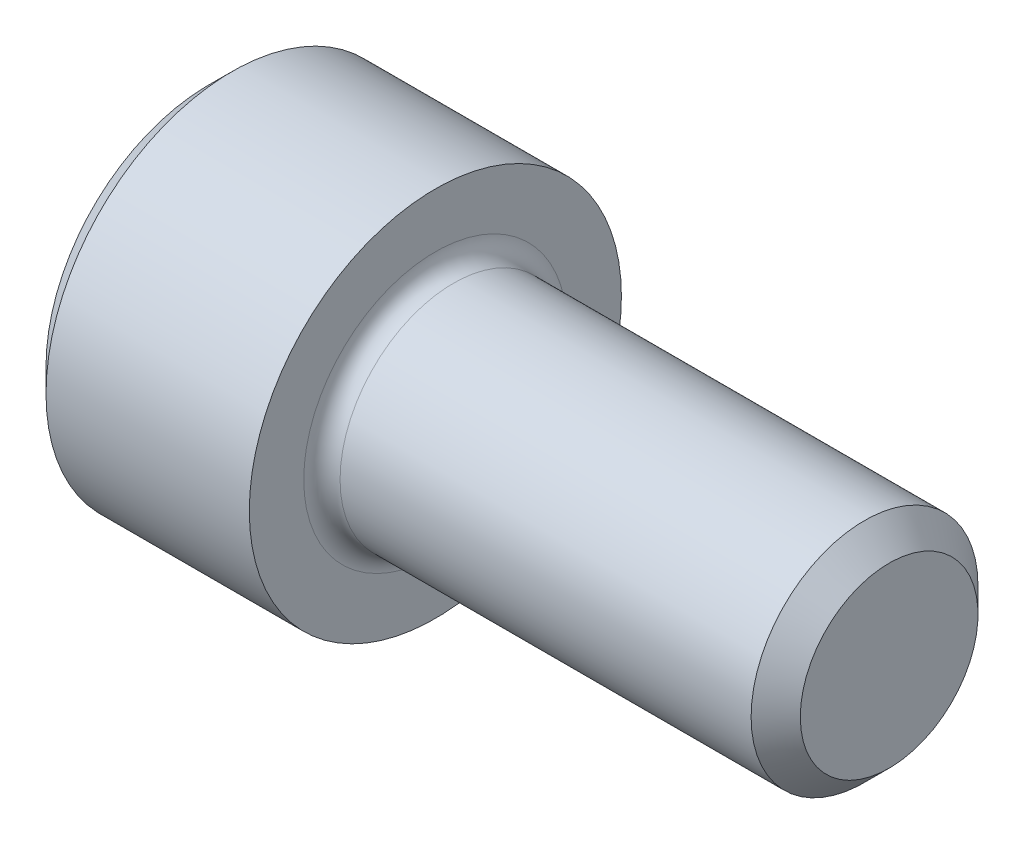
from build123d import *

# Parameters (mm, degrees)
FILLET1_R   = 0.254
HEX_2_DEPTH = 1.4478


with BuildPart() as part:
    # BodySke → Base-Revolve (revolve)
    with BuildSketch(Plane.XY, mode=Mode.PRIVATE) as base_revolve_sk:
        Polygon((0, 0), (0, 2.2733), (0.3302, 2.6035), (3.175, 2.6035), (3.175, 1.5875), (9.18083, 1.5875), (9.525, 1.24333), (9.525, 0), align=None)
    revolve(base_revolve_sk.sketch.rotate(Axis((-31.75, 0, 0), (1, 0, 0)), 90), axis=Axis((-31.75, 0, 0), (1, 0, 0)))

    # Fillet1
    fillet1_edges = [part.edges().sort_by_distance(p)[0] for p in [
        (3.175, 0, -1.5875),
    ]]
    fillet(fillet1_edges, radius=FILLET1_R)

    # Sketch2 → Hex-PreBroach (revolve, cut)
    with BuildSketch(Plane.XY, mode=Mode.PRIVATE) as hex_prebroach_sk:
        Polygon((0, 1.1938), (1.4478, 1.1938), (2.137040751, 0), (0, 0), align=None)
    revolve(hex_prebroach_sk.sketch.rotate(Axis((0, 0, 0), (1, 0, 0)), 90), axis=Axis((0, 0, 0), (1, 0, 0)), mode=Mode.SUBTRACT)

    # Sketch3 → Hex 2 (cut)
    with BuildSketch(Plane(origin=(0, 0, 0), x_dir=(0, 0.500000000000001, 0.866025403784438), z_dir=(-1, 0, 0))):
        Polygon((0.689240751, 1.1938), (-0.689240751, 1.1938), (-1.378481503, 0), (-0.689240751, -1.1938), (0.689240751, -1.1938), (1.378481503, 0), align=None)
    extrude(amount=-HEX_2_DEPTH, mode=Mode.SUBTRACT)


solid = part.part
